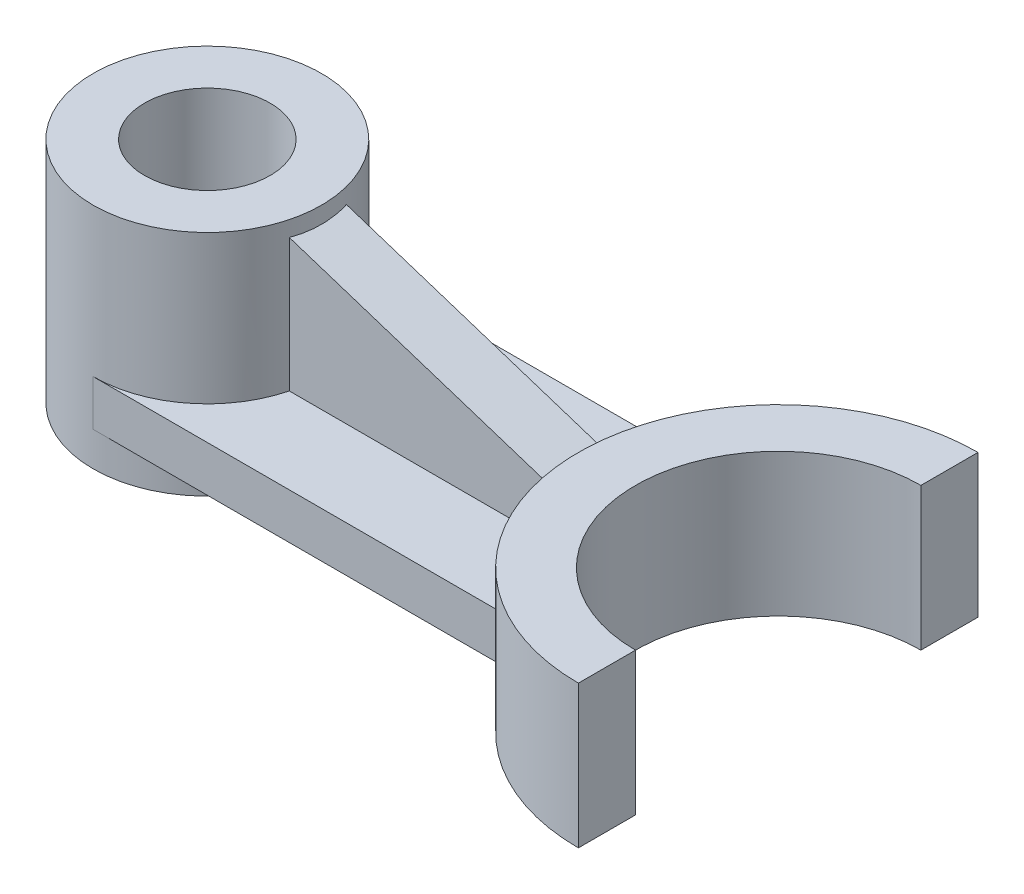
ISO-10303-21;
HEADER;
FILE_DESCRIPTION(('STEP AP214'),'2;1');
FILE_NAME('part.step','',(''),(''),'','','');
FILE_SCHEMA(('AUTOMOTIVE_DESIGN { 1 0 10303 214 1 1 1 1 }'));
ENDSEC;
DATA;
#1=APPLICATION_CONTEXT('core data for automotive mechanical design processes');
#2=APPLICATION_PROTOCOL_DEFINITION('international standard','automotive_design',2000,#1);
#3=PRODUCT_CONTEXT('',#1,'mechanical');
#4=PRODUCT('Part','Part','',(#3));
#5=PRODUCT_RELATED_PRODUCT_CATEGORY('part','',(#4));
#6=PRODUCT_DEFINITION_FORMATION('','',#4);
#7=PRODUCT_DEFINITION_CONTEXT('part definition',#1,'design');
#8=PRODUCT_DEFINITION('design','',#6,#7);
#9=PRODUCT_DEFINITION_SHAPE('','',#8);
#10=(LENGTH_UNIT() NAMED_UNIT(*) SI_UNIT(.MILLI.,.METRE.));
#11=(NAMED_UNIT(*) PLANE_ANGLE_UNIT() SI_UNIT($,.RADIAN.));
#12=(NAMED_UNIT(*) SI_UNIT($,.STERADIAN.) SOLID_ANGLE_UNIT());
#13=UNCERTAINTY_MEASURE_WITH_UNIT(LENGTH_MEASURE(1.E-05),#10,'distance_accuracy_value','');
#14=(GEOMETRIC_REPRESENTATION_CONTEXT(3) GLOBAL_UNCERTAINTY_ASSIGNED_CONTEXT((#13)) GLOBAL_UNIT_ASSIGNED_CONTEXT((#10,
#11,#12)) REPRESENTATION_CONTEXT('',''));
#15=CARTESIAN_POINT('',(0.,0.,0.));
#16=DIRECTION('',(0.,0.,1.));
#17=DIRECTION('',(1.,0.,0.));
#18=AXIS2_PLACEMENT_3D('',#15,#16,#17);
#19=CARTESIAN_POINT('',(0.,14.,0.));
#20=DIRECTION('',(0.,1.,0.));
#21=DIRECTION('',(0.,0.,1.));
#22=AXIS2_PLACEMENT_3D('',#19,#20,#21);
#23=PLANE('',#22);
#24=CARTESIAN_POINT('',(0.,14.,0.));
#25=DIRECTION('',(0.,-1.,0.));
#26=DIRECTION('',(0.,0.,1.));
#27=AXIS2_PLACEMENT_3D('',#24,#25,#26);
#28=CIRCLE('',#27,20.);
#29=CARTESIAN_POINT('',(0.,14.,-20.));
#30=VERTEX_POINT('',#29);
#31=CARTESIAN_POINT('',(19.3649167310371,14.,-5.));
#32=VERTEX_POINT('',#31);
#33=EDGE_CURVE('E136',#30,#32,#28,.T.);
#34=ORIENTED_EDGE('',*,*,#33,.T.);
#35=DIRECTION('',(1.,0.,0.));
#36=VECTOR('',#35,1.);
#37=CARTESIAN_POINT('',(0.,14.,-5.));
#38=LINE('',#37,#36);
#39=CARTESIAN_POINT('',(65.3589838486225,14.,-5.));
#40=VERTEX_POINT('',#39);
#41=EDGE_CURVE('E135',#32,#40,#38,.T.);
#42=ORIENTED_EDGE('',*,*,#41,.T.);
#43=CARTESIAN_POINT('',(100.,14.,0.));
#44=DIRECTION('',(0.,-1.,0.));
#45=DIRECTION('',(0.,0.,-1.));
#46=AXIS2_PLACEMENT_3D('',#43,#44,#45);
#47=CIRCLE('',#46,35.);
#48=CARTESIAN_POINT('',(71.2771867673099,14.,-20.));
#49=VERTEX_POINT('',#48);
#50=EDGE_CURVE('E119',#40,#49,#47,.T.);
#51=ORIENTED_EDGE('',*,*,#50,.T.);
#52=DIRECTION('',(-1.,0.,0.));
#53=VECTOR('',#52,1.);
#54=CARTESIAN_POINT('',(0.,14.,-20.));
#55=LINE('',#54,#53);
#56=EDGE_CURVE('E194',#49,#30,#55,.T.);
#57=ORIENTED_EDGE('',*,*,#56,.T.);
#58=EDGE_LOOP('',(#34,#42,#51,#57));
#59=FACE_BOUND('',#58,.T.);
#60=ADVANCED_FACE('F33',(#59),#23,.T.);
#61=CARTESIAN_POINT('',(0.,40.,0.));
#62=DIRECTION('',(0.,-1.,0.));
#63=DIRECTION('',(0.,0.,-1.));
#64=AXIS2_PLACEMENT_3D('',#61,#62,#63);
#65=CYLINDRICAL_SURFACE('',#64,11.);
#66=CARTESIAN_POINT('',(0.,0.,0.));
#67=DIRECTION('',(0.,1.,0.));
#68=DIRECTION('',(0.,0.,1.));
#69=AXIS2_PLACEMENT_3D('',#66,#67,#68);
#70=CIRCLE('',#69,11.);
#71=CARTESIAN_POINT('',(0.,0.,11.));
#72=VERTEX_POINT('',#71);
#73=EDGE_CURVE('E213',#72,#72,#70,.T.);
#74=ORIENTED_EDGE('',*,*,#73,.F.);
#75=EDGE_LOOP('',(#74));
#76=FACE_BOUND('',#75,.T.);
#77=CARTESIAN_POINT('',(0.,40.,0.));
#78=DIRECTION('',(0.,1.,0.));
#79=DIRECTION('',(0.,0.,1.));
#80=AXIS2_PLACEMENT_3D('',#77,#78,#79);
#81=CIRCLE('',#80,11.);
#82=CARTESIAN_POINT('',(0.,40.,11.));
#83=VERTEX_POINT('',#82);
#84=EDGE_CURVE('E214',#83,#83,#81,.T.);
#85=ORIENTED_EDGE('',*,*,#84,.T.);
#86=EDGE_LOOP('',(#85));
#87=FACE_BOUND('',#86,.T.);
#88=ADVANCED_FACE('F35',(#76,#87),#65,.F.);
#89=CARTESIAN_POINT('',(0.,40.,0.));
#90=DIRECTION('',(0.,-1.,0.));
#91=DIRECTION('',(0.,0.,-1.));
#92=AXIS2_PLACEMENT_3D('',#89,#90,#91);
#93=CYLINDRICAL_SURFACE('',#92,20.);
#94=CARTESIAN_POINT('',(0.,0.,0.));
#95=DIRECTION('',(0.,1.,0.));
#96=DIRECTION('',(0.,0.,1.));
#97=AXIS2_PLACEMENT_3D('',#94,#95,#96);
#98=CIRCLE('',#97,20.);
#99=CARTESIAN_POINT('',(0.,0.,20.));
#100=VERTEX_POINT('',#99);
#101=EDGE_CURVE('E217',#100,#100,#98,.T.);
#102=ORIENTED_EDGE('',*,*,#101,.T.);
#103=EDGE_LOOP('',(#102));
#104=FACE_BOUND('',#103,.T.);
#105=CARTESIAN_POINT('',(0.,6.,0.));
#106=DIRECTION('',(0.,-1.,0.));
#107=DIRECTION('',(0.,0.,1.));
#108=AXIS2_PLACEMENT_3D('',#105,#106,#107);
#109=CIRCLE('',#108,20.);
#110=CARTESIAN_POINT('',(0.,6.,-20.));
#111=VERTEX_POINT('',#110);
#112=CARTESIAN_POINT('',(0.,6.,20.));
#113=VERTEX_POINT('',#112);
#114=EDGE_CURVE('E189',#111,#113,#109,.T.);
#115=ORIENTED_EDGE('',*,*,#114,.T.);
#116=DIRECTION('',(0.,-1.,0.));
#117=VECTOR('',#116,1.);
#118=CARTESIAN_POINT('',(0.,14.,20.));
#119=LINE('',#118,#117);
#120=CARTESIAN_POINT('',(0.,14.,20.));
#121=VERTEX_POINT('',#120);
#122=EDGE_CURVE('E210',#121,#113,#119,.T.);
#123=ORIENTED_EDGE('',*,*,#122,.F.);
#124=CARTESIAN_POINT('',(19.3649167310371,14.,5.));
#125=VERTEX_POINT('',#124);
#126=EDGE_CURVE('E191',#125,#121,#28,.T.);
#127=ORIENTED_EDGE('',*,*,#126,.F.);
#128=DIRECTION('',(0.,-1.,0.));
#129=VECTOR('',#128,1.);
#130=CARTESIAN_POINT('',(19.3649167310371,40.,5.));
#131=LINE('',#130,#129);
#132=CARTESIAN_POINT('',(19.3649167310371,37.285795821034,5.));
#133=VERTEX_POINT('',#132);
#134=EDGE_CURVE('E48',#125,#133,#131,.F.);
#135=ORIENTED_EDGE('',*,*,#134,.T.);
#136=CARTESIAN_POINT('',(0.,43.564105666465,0.));
#137=DIRECTION('',(0.308406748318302,0.951254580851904,0.));
#138=DIRECTION('',(0.951254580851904,-0.308406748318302,0.));
#139=AXIS2_PLACEMENT_3D('',#136,#137,#138);
#140=ELLIPSE('',#139,21.0248659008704,20.);
#141=CARTESIAN_POINT('',(19.3649167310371,37.285795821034,-5.));
#142=VERTEX_POINT('',#141);
#143=EDGE_CURVE('E52',#133,#142,#140,.T.);
#144=ORIENTED_EDGE('',*,*,#143,.T.);
#145=DIRECTION('',(0.,-1.,0.));
#146=VECTOR('',#145,1.);
#147=CARTESIAN_POINT('',(19.3649167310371,40.,-5.));
#148=LINE('',#147,#146);
#149=EDGE_CURVE('E138',#32,#142,#148,.F.);
#150=ORIENTED_EDGE('',*,*,#149,.F.);
#151=ORIENTED_EDGE('',*,*,#33,.F.);
#152=DIRECTION('',(0.,-1.,0.));
#153=VECTOR('',#152,1.);
#154=CARTESIAN_POINT('',(0.,14.,-20.));
#155=LINE('',#154,#153);
#156=EDGE_CURVE('E196',#30,#111,#155,.T.);
#157=ORIENTED_EDGE('',*,*,#156,.T.);
#158=EDGE_LOOP('',(#115,#123,#127,#135,#144,#150,#151,#157));
#159=FACE_BOUND('',#158,.T.);
#160=CARTESIAN_POINT('',(0.,40.,0.));
#161=DIRECTION('',(0.,1.,0.));
#162=DIRECTION('',(0.,0.,1.));
#163=AXIS2_PLACEMENT_3D('',#160,#161,#162);
#164=CIRCLE('',#163,20.);
#165=CARTESIAN_POINT('',(0.,40.,20.));
#166=VERTEX_POINT('',#165);
#167=EDGE_CURVE('E41',#166,#166,#164,.T.);
#168=ORIENTED_EDGE('',*,*,#167,.F.);
#169=EDGE_LOOP('',(#168));
#170=FACE_BOUND('',#169,.T.);
#171=ADVANCED_FACE('F224',(#104,#159,#170),#93,.T.);
#172=CARTESIAN_POINT('',(-68.1992762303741,40.,0.));
#173=DIRECTION('',(0.,1.,0.));
#174=DIRECTION('',(0.,0.,1.));
#175=AXIS2_PLACEMENT_3D('',#172,#173,#174);
#176=PLANE('',#175);
#177=ORIENTED_EDGE('',*,*,#84,.F.);
#178=EDGE_LOOP('',(#177));
#179=FACE_BOUND('',#178,.T.);
#180=ORIENTED_EDGE('',*,*,#167,.T.);
#181=EDGE_LOOP('',(#180));
#182=FACE_BOUND('',#181,.T.);
#183=ADVANCED_FACE('F229',(#179,#182),#176,.T.);
#184=CARTESIAN_POINT('',(-68.1992762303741,0.,0.));
#185=DIRECTION('',(0.,1.,0.));
#186=DIRECTION('',(0.,0.,1.));
#187=AXIS2_PLACEMENT_3D('',#184,#185,#186);
#188=PLANE('',#187);
#189=ORIENTED_EDGE('',*,*,#73,.T.);
#190=EDGE_LOOP('',(#189));
#191=FACE_BOUND('',#190,.T.);
#192=ORIENTED_EDGE('',*,*,#101,.F.);
#193=EDGE_LOOP('',(#192));
#194=FACE_BOUND('',#193,.T.);
#195=ADVANCED_FACE('F226',(#191,#194),#188,.F.);
#196=CARTESIAN_POINT('',(0.,14.,20.));
#197=DIRECTION('',(0.,0.,-1.));
#198=DIRECTION('',(-1.,0.,0.));
#199=AXIS2_PLACEMENT_3D('',#196,#197,#198);
#200=PLANE('',#199);
#201=DIRECTION('',(1.,0.,0.));
#202=VECTOR('',#201,1.);
#203=CARTESIAN_POINT('',(0.,6.,20.));
#204=LINE('',#203,#202);
#205=CARTESIAN_POINT('',(71.2771867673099,6.,20.));
#206=VERTEX_POINT('',#205);
#207=EDGE_CURVE('E198',#113,#206,#204,.T.);
#208=ORIENTED_EDGE('',*,*,#207,.T.);
#209=DIRECTION('',(0.,-1.,0.));
#210=VECTOR('',#209,1.);
#211=CARTESIAN_POINT('',(71.2771867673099,14.,20.));
#212=LINE('',#211,#210);
#213=CARTESIAN_POINT('',(71.2771867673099,14.,20.));
#214=VERTEX_POINT('',#213);
#215=EDGE_CURVE('E207',#214,#206,#212,.T.);
#216=ORIENTED_EDGE('',*,*,#215,.F.);
#217=DIRECTION('',(1.,0.,0.));
#218=VECTOR('',#217,1.);
#219=CARTESIAN_POINT('',(0.,14.,20.));
#220=LINE('',#219,#218);
#221=EDGE_CURVE('E131',#121,#214,#220,.T.);
#222=ORIENTED_EDGE('',*,*,#221,.F.);
#223=ORIENTED_EDGE('',*,*,#122,.T.);
#224=EDGE_LOOP('',(#208,#216,#222,#223));
#225=FACE_BOUND('',#224,.T.);
#226=ADVANCED_FACE('F228',(#225),#200,.F.);
#227=CARTESIAN_POINT('',(0.,14.,-20.));
#228=DIRECTION('',(0.,0.,1.));
#229=DIRECTION('',(1.,0.,0.));
#230=AXIS2_PLACEMENT_3D('',#227,#228,#229);
#231=PLANE('',#230);
#232=DIRECTION('',(-1.,0.,0.));
#233=VECTOR('',#232,1.);
#234=CARTESIAN_POINT('',(0.,6.,-20.));
#235=LINE('',#234,#233);
#236=CARTESIAN_POINT('',(71.2771867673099,6.,-20.));
#237=VERTEX_POINT('',#236);
#238=EDGE_CURVE('E202',#237,#111,#235,.T.);
#239=ORIENTED_EDGE('',*,*,#238,.T.);
#240=ORIENTED_EDGE('',*,*,#156,.F.);
#241=ORIENTED_EDGE('',*,*,#56,.F.);
#242=DIRECTION('',(0.,-1.,0.));
#243=VECTOR('',#242,1.);
#244=CARTESIAN_POINT('',(71.2771867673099,14.,-20.));
#245=LINE('',#244,#243);
#246=EDGE_CURVE('E126',#49,#237,#245,.T.);
#247=ORIENTED_EDGE('',*,*,#246,.T.);
#248=EDGE_LOOP('',(#239,#240,#241,#247));
#249=FACE_BOUND('',#248,.T.);
#250=ADVANCED_FACE('F236',(#249),#231,.F.);
#251=DIRECTION('',(1.,0.,0.));
#252=VECTOR('',#251,1.);
#253=CARTESIAN_POINT('',(0.,14.,5.));
#254=LINE('',#253,#252);
#255=CARTESIAN_POINT('',(65.3589838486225,14.,5.));
#256=VERTEX_POINT('',#255);
#257=EDGE_CURVE('E153',#125,#256,#254,.T.);
#258=ORIENTED_EDGE('',*,*,#257,.F.);
#259=ORIENTED_EDGE('',*,*,#126,.T.);
#260=ORIENTED_EDGE('',*,*,#221,.T.);
#261=EDGE_CURVE('E130',#214,#256,#47,.T.);
#262=ORIENTED_EDGE('',*,*,#261,.T.);
#263=EDGE_LOOP('',(#258,#259,#260,#262));
#264=FACE_BOUND('',#263,.T.);
#265=ADVANCED_FACE('F243',(#264),#23,.T.);
#266=CARTESIAN_POINT('',(0.,6.,0.));
#267=DIRECTION('',(0.,1.,0.));
#268=DIRECTION('',(0.,0.,1.));
#269=AXIS2_PLACEMENT_3D('',#266,#267,#268);
#270=PLANE('',#269);
#271=ORIENTED_EDGE('',*,*,#207,.F.);
#272=ORIENTED_EDGE('',*,*,#114,.F.);
#273=ORIENTED_EDGE('',*,*,#238,.F.);
#274=CARTESIAN_POINT('',(100.,6.,0.));
#275=DIRECTION('',(0.,-1.,0.));
#276=DIRECTION('',(0.,0.,-1.));
#277=AXIS2_PLACEMENT_3D('',#274,#275,#276);
#278=CIRCLE('',#277,35.);
#279=EDGE_CURVE('E200',#206,#237,#278,.T.);
#280=ORIENTED_EDGE('',*,*,#279,.F.);
#281=EDGE_LOOP('',(#271,#272,#273,#280));
#282=FACE_BOUND('',#281,.T.);
#283=ADVANCED_FACE('F251',(#282),#270,.F.);
#284=CARTESIAN_POINT('',(100.,25.,0.));
#285=DIRECTION('',(0.,-1.,0.));
#286=DIRECTION('',(0.,0.,-1.));
#287=AXIS2_PLACEMENT_3D('',#284,#285,#286);
#288=CYLINDRICAL_SURFACE('',#287,25.);
#289=DIRECTION('',(0.,-1.,0.));
#290=VECTOR('',#289,1.);
#291=CARTESIAN_POINT('',(100.,25.,25.));
#292=LINE('',#291,#290);
#293=CARTESIAN_POINT('',(100.,25.,25.));
#294=VERTEX_POINT('',#293);
#295=CARTESIAN_POINT('',(100.,0.,25.));
#296=VERTEX_POINT('',#295);
#297=EDGE_CURVE('E171',#294,#296,#292,.T.);
#298=ORIENTED_EDGE('',*,*,#297,.T.);
#299=CARTESIAN_POINT('',(100.,0.,0.));
#300=DIRECTION('',(0.,1.,0.));
#301=DIRECTION('',(0.,0.,1.));
#302=AXIS2_PLACEMENT_3D('',#299,#300,#301);
#303=CIRCLE('',#302,25.);
#304=CARTESIAN_POINT('',(100.,0.,-25.));
#305=VERTEX_POINT('',#304);
#306=EDGE_CURVE('E158',#305,#296,#303,.T.);
#307=ORIENTED_EDGE('',*,*,#306,.F.);
#308=DIRECTION('',(0.,-1.,0.));
#309=VECTOR('',#308,1.);
#310=CARTESIAN_POINT('',(100.,25.,-25.));
#311=LINE('',#310,#309);
#312=CARTESIAN_POINT('',(100.,25.,-25.));
#313=VERTEX_POINT('',#312);
#314=EDGE_CURVE('E187',#313,#305,#311,.T.);
#315=ORIENTED_EDGE('',*,*,#314,.F.);
#316=CARTESIAN_POINT('',(100.,25.,0.));
#317=DIRECTION('',(0.,1.,0.));
#318=DIRECTION('',(0.,0.,1.));
#319=AXIS2_PLACEMENT_3D('',#316,#317,#318);
#320=CIRCLE('',#319,25.);
#321=EDGE_CURVE('E159',#313,#294,#320,.T.);
#322=ORIENTED_EDGE('',*,*,#321,.T.);
#323=EDGE_LOOP('',(#298,#307,#315,#322));
#324=FACE_BOUND('',#323,.T.);
#325=ADVANCED_FACE('F257',(#324),#288,.F.);
#326=CARTESIAN_POINT('',(100.,25.,0.));
#327=DIRECTION('',(1.,0.,0.));
#328=DIRECTION('',(0.,0.,-1.));
#329=AXIS2_PLACEMENT_3D('',#326,#327,#328);
#330=PLANE('',#329);
#331=DIRECTION('',(0.,0.,1.));
#332=VECTOR('',#331,1.);
#333=CARTESIAN_POINT('',(100.,0.,0.));
#334=LINE('',#333,#332);
#335=CARTESIAN_POINT('',(100.,0.,-35.));
#336=VERTEX_POINT('',#335);
#337=EDGE_CURVE('E173',#336,#305,#334,.T.);
#338=ORIENTED_EDGE('',*,*,#337,.F.);
#339=DIRECTION('',(0.,-1.,0.));
#340=VECTOR('',#339,1.);
#341=CARTESIAN_POINT('',(100.,25.,-35.));
#342=LINE('',#341,#340);
#343=CARTESIAN_POINT('',(100.,25.,-35.));
#344=VERTEX_POINT('',#343);
#345=EDGE_CURVE('E185',#344,#336,#342,.T.);
#346=ORIENTED_EDGE('',*,*,#345,.F.);
#347=DIRECTION('',(0.,0.,1.));
#348=VECTOR('',#347,1.);
#349=CARTESIAN_POINT('',(100.,25.,0.));
#350=LINE('',#349,#348);
#351=EDGE_CURVE('E162',#344,#313,#350,.T.);
#352=ORIENTED_EDGE('',*,*,#351,.T.);
#353=ORIENTED_EDGE('',*,*,#314,.T.);
#354=EDGE_LOOP('',(#338,#346,#352,#353));
#355=FACE_BOUND('',#354,.T.);
#356=ADVANCED_FACE('F299',(#355),#330,.T.);
#357=CARTESIAN_POINT('',(100.,25.,0.));
#358=DIRECTION('',(0.,-1.,0.));
#359=DIRECTION('',(0.,0.,-1.));
#360=AXIS2_PLACEMENT_3D('',#357,#358,#359);
#361=CYLINDRICAL_SURFACE('',#360,35.);
#362=CARTESIAN_POINT('',(100.,0.,0.));
#363=DIRECTION('',(0.,1.,0.));
#364=DIRECTION('',(0.,0.,1.));
#365=AXIS2_PLACEMENT_3D('',#362,#363,#364);
#366=CIRCLE('',#365,35.);
#367=CARTESIAN_POINT('',(100.,0.,35.));
#368=VERTEX_POINT('',#367);
#369=EDGE_CURVE('E176',#336,#368,#366,.T.);
#370=ORIENTED_EDGE('',*,*,#369,.T.);
#371=DIRECTION('',(0.,-1.,0.));
#372=VECTOR('',#371,1.);
#373=CARTESIAN_POINT('',(100.,25.,35.));
#374=LINE('',#373,#372);
#375=CARTESIAN_POINT('',(100.,25.,35.));
#376=VERTEX_POINT('',#375);
#377=EDGE_CURVE('E182',#376,#368,#374,.T.);
#378=ORIENTED_EDGE('',*,*,#377,.F.);
#379=CARTESIAN_POINT('',(100.,25.,0.));
#380=DIRECTION('',(0.,1.,0.));
#381=DIRECTION('',(0.,0.,1.));
#382=AXIS2_PLACEMENT_3D('',#379,#380,#381);
#383=CIRCLE('',#382,35.);
#384=EDGE_CURVE('E166',#344,#376,#383,.T.);
#385=ORIENTED_EDGE('',*,*,#384,.F.);
#386=ORIENTED_EDGE('',*,*,#345,.T.);
#387=EDGE_LOOP('',(#370,#378,#385,#386));
#388=FACE_BOUND('',#387,.T.);
#389=ORIENTED_EDGE('',*,*,#279,.T.);
#390=ORIENTED_EDGE('',*,*,#246,.F.);
#391=ORIENTED_EDGE('',*,*,#50,.F.);
#392=DIRECTION('',(0.,-1.,0.));
#393=VECTOR('',#392,1.);
#394=CARTESIAN_POINT('',(65.3589838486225,25.,-5.));
#395=LINE('',#394,#393);
#396=CARTESIAN_POINT('',(65.3589838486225,22.3740351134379,-5.));
#397=VERTEX_POINT('',#396);
#398=EDGE_CURVE('E123',#397,#40,#395,.T.);
#399=ORIENTED_EDGE('',*,*,#398,.F.);
#400=CARTESIAN_POINT('',(100.,11.1430530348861,0.));
#401=DIRECTION('',(0.308406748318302,0.951254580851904,0.));
#402=DIRECTION('',(0.951254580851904,-0.308406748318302,0.));
#403=AXIS2_PLACEMENT_3D('',#400,#401,#402);
#404=ELLIPSE('',#403,36.7935153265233,35.);
#405=CARTESIAN_POINT('',(65.3589838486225,22.3740351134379,5.));
#406=VERTEX_POINT('',#405);
#407=EDGE_CURVE('E11',#397,#406,#404,.T.);
#408=ORIENTED_EDGE('',*,*,#407,.T.);
#409=DIRECTION('',(0.,-1.,0.));
#410=VECTOR('',#409,1.);
#411=CARTESIAN_POINT('',(65.3589838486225,25.,5.));
#412=LINE('',#411,#410);
#413=EDGE_CURVE('E150',#406,#256,#412,.T.);
#414=ORIENTED_EDGE('',*,*,#413,.T.);
#415=ORIENTED_EDGE('',*,*,#261,.F.);
#416=ORIENTED_EDGE('',*,*,#215,.T.);
#417=EDGE_LOOP('',(#389,#390,#391,#399,#408,#414,#415,#416));
#418=FACE_BOUND('',#417,.T.);
#419=ADVANCED_FACE('F121',(#388,#418),#361,.T.);
#420=CARTESIAN_POINT('',(100.,25.,0.));
#421=DIRECTION('',(1.,0.,0.));
#422=DIRECTION('',(0.,0.,-1.));
#423=AXIS2_PLACEMENT_3D('',#420,#421,#422);
#424=PLANE('',#423);
#425=DIRECTION('',(0.,0.,1.));
#426=VECTOR('',#425,1.);
#427=CARTESIAN_POINT('',(100.,0.,0.));
#428=LINE('',#427,#426);
#429=EDGE_CURVE('E163',#296,#368,#428,.T.);
#430=ORIENTED_EDGE('',*,*,#429,.F.);
#431=ORIENTED_EDGE('',*,*,#297,.F.);
#432=DIRECTION('',(0.,0.,1.));
#433=VECTOR('',#432,1.);
#434=CARTESIAN_POINT('',(100.,25.,0.));
#435=LINE('',#434,#433);
#436=EDGE_CURVE('E168',#294,#376,#435,.T.);
#437=ORIENTED_EDGE('',*,*,#436,.T.);
#438=ORIENTED_EDGE('',*,*,#377,.T.);
#439=EDGE_LOOP('',(#430,#431,#437,#438));
#440=FACE_BOUND('',#439,.T.);
#441=ADVANCED_FACE('F291',(#440),#424,.T.);
#442=CARTESIAN_POINT('',(-68.1992762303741,25.,0.));
#443=DIRECTION('',(0.,1.,0.));
#444=DIRECTION('',(0.,0.,1.));
#445=AXIS2_PLACEMENT_3D('',#442,#443,#444);
#446=PLANE('',#445);
#447=ORIENTED_EDGE('',*,*,#321,.F.);
#448=ORIENTED_EDGE('',*,*,#351,.F.);
#449=ORIENTED_EDGE('',*,*,#384,.T.);
#450=ORIENTED_EDGE('',*,*,#436,.F.);
#451=EDGE_LOOP('',(#447,#448,#449,#450));
#452=FACE_BOUND('',#451,.T.);
#453=ADVANCED_FACE('F285',(#452),#446,.T.);
#454=CARTESIAN_POINT('',(-68.1992762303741,0.,0.));
#455=DIRECTION('',(0.,1.,0.));
#456=DIRECTION('',(0.,0.,1.));
#457=AXIS2_PLACEMENT_3D('',#454,#455,#456);
#458=PLANE('',#457);
#459=ORIENTED_EDGE('',*,*,#429,.T.);
#460=ORIENTED_EDGE('',*,*,#369,.F.);
#461=ORIENTED_EDGE('',*,*,#337,.T.);
#462=ORIENTED_EDGE('',*,*,#306,.T.);
#463=EDGE_LOOP('',(#459,#460,#461,#462));
#464=FACE_BOUND('',#463,.T.);
#465=ADVANCED_FACE('F278',(#464),#458,.F.);
#466=CARTESIAN_POINT('',(65.,22.4904214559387,0.));
#467=DIRECTION('',(0.308406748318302,0.951254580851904,0.));
#468=DIRECTION('',(-0.951254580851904,0.308406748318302,0.));
#469=AXIS2_PLACEMENT_3D('',#466,#467,#468);
#470=PLANE('',#469);
#471=ORIENTED_EDGE('',*,*,#143,.F.);
#472=DIRECTION('',(-0.951254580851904,0.308406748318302,0.));
#473=VECTOR('',#472,1.);
#474=CARTESIAN_POINT('',(65.,22.4904214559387,5.));
#475=LINE('',#474,#473);
#476=EDGE_CURVE('E144',#406,#133,#475,.T.);
#477=ORIENTED_EDGE('',*,*,#476,.F.);
#478=ORIENTED_EDGE('',*,*,#407,.F.);
#479=DIRECTION('',(-0.951254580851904,0.308406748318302,0.));
#480=VECTOR('',#479,1.);
#481=CARTESIAN_POINT('',(65.,22.4904214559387,-5.));
#482=LINE('',#481,#480);
#483=EDGE_CURVE('E143',#397,#142,#482,.T.);
#484=ORIENTED_EDGE('',*,*,#483,.T.);
#485=EDGE_LOOP('',(#471,#477,#478,#484));
#486=FACE_BOUND('',#485,.T.);
#487=ADVANCED_FACE('F270',(#486),#470,.T.);
#488=CARTESIAN_POINT('',(40.,20.,5.));
#489=DIRECTION('',(0.,0.,1.));
#490=DIRECTION('',(1.,0.,0.));
#491=AXIS2_PLACEMENT_3D('',#488,#489,#490);
#492=PLANE('',#491);
#493=ORIENTED_EDGE('',*,*,#134,.F.);
#494=ORIENTED_EDGE('',*,*,#257,.T.);
#495=ORIENTED_EDGE('',*,*,#413,.F.);
#496=ORIENTED_EDGE('',*,*,#476,.T.);
#497=EDGE_LOOP('',(#493,#494,#495,#496));
#498=FACE_BOUND('',#497,.T.);
#499=ADVANCED_FACE('F267',(#498),#492,.T.);
#500=CARTESIAN_POINT('',(40.,20.,-5.));
#501=DIRECTION('',(0.,0.,1.));
#502=DIRECTION('',(1.,0.,0.));
#503=AXIS2_PLACEMENT_3D('',#500,#501,#502);
#504=PLANE('',#503);
#505=ORIENTED_EDGE('',*,*,#41,.F.);
#506=ORIENTED_EDGE('',*,*,#149,.T.);
#507=ORIENTED_EDGE('',*,*,#483,.F.);
#508=ORIENTED_EDGE('',*,*,#398,.T.);
#509=EDGE_LOOP('',(#505,#506,#507,#508));
#510=FACE_BOUND('',#509,.T.);
#511=ADVANCED_FACE('F141',(#510),#504,.F.);
#512=CLOSED_SHELL('',(#60,#88,#171,#183,#195,#226,#250,#265,#283,#325,#356,#419,#441,#453,#465,
#487,#499,#511));
#513=MANIFOLD_SOLID_BREP('B2',#512);
#514=ADVANCED_BREP_SHAPE_REPRESENTATION('',(#18,#513),#14);
#515=SHAPE_DEFINITION_REPRESENTATION(#9,#514);
ENDSEC;
END-ISO-10303-21;
